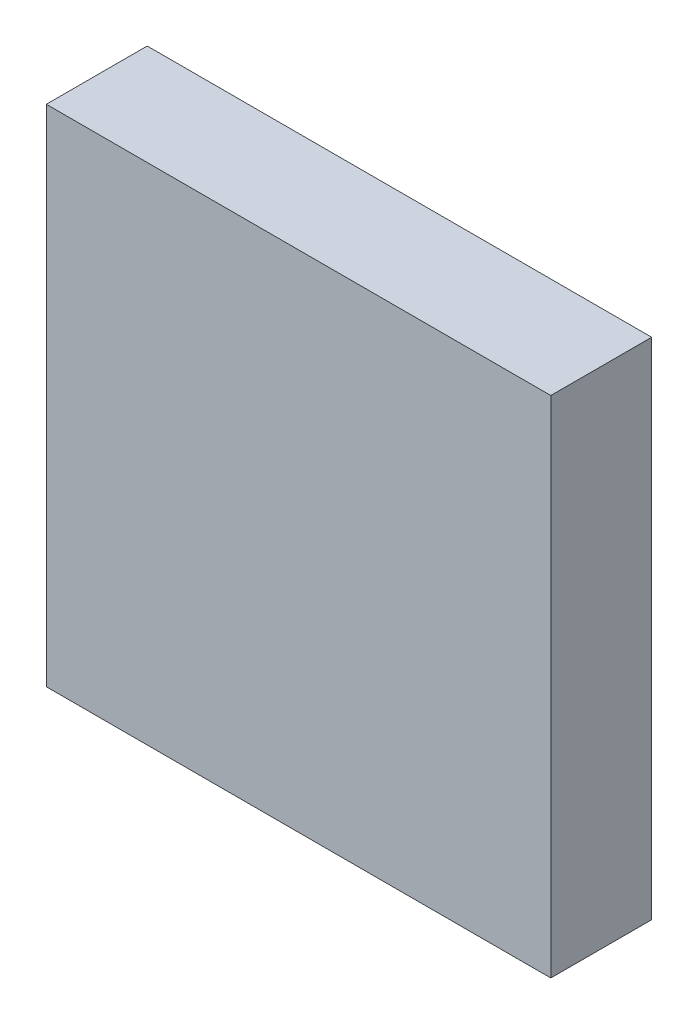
from build123d import *

# Parameters (mm, degrees)
ESQUISSE1_W        = 4
ESQUISSE1_H        = 4
BOSS_EXTRU_1_DEPTH = 0.8


with BuildPart() as part:
    # Esquisse1 → Boss.-Extru.1 (new body)
    with BuildSketch(Plane.XY):
        Rectangle(ESQUISSE1_W, ESQUISSE1_H)
    extrude(amount=BOSS_EXTRU_1_DEPTH)


solid = part.part
